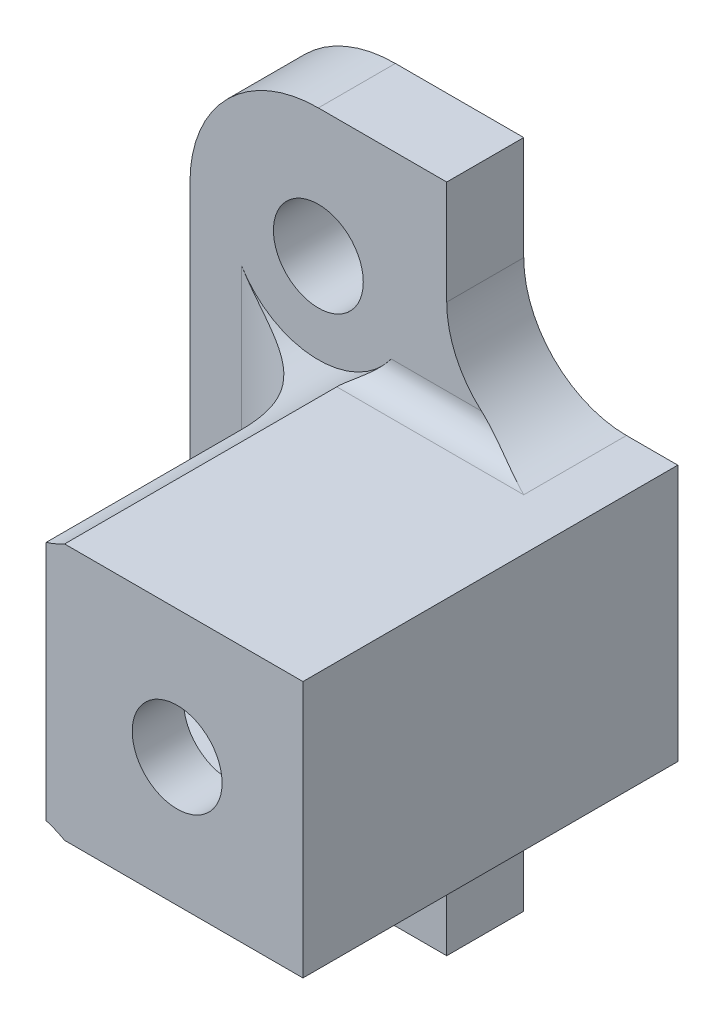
ISO-10303-21;
HEADER;
FILE_DESCRIPTION(('STEP AP214'),'2;1');
FILE_NAME('part.step','',(''),(''),'','','');
FILE_SCHEMA(('AUTOMOTIVE_DESIGN { 1 0 10303 214 1 1 1 1 }'));
ENDSEC;
DATA;
#1=APPLICATION_CONTEXT('core data for automotive mechanical design processes');
#2=APPLICATION_PROTOCOL_DEFINITION('international standard','automotive_design',2000,#1);
#3=PRODUCT_CONTEXT('',#1,'mechanical');
#4=PRODUCT('Part','Part','',(#3));
#5=PRODUCT_RELATED_PRODUCT_CATEGORY('part','',(#4));
#6=PRODUCT_DEFINITION_FORMATION('','',#4);
#7=PRODUCT_DEFINITION_CONTEXT('part definition',#1,'design');
#8=PRODUCT_DEFINITION('design','',#6,#7);
#9=PRODUCT_DEFINITION_SHAPE('','',#8);
#10=(LENGTH_UNIT() NAMED_UNIT(*) SI_UNIT(.MILLI.,.METRE.));
#11=(NAMED_UNIT(*) PLANE_ANGLE_UNIT() SI_UNIT($,.RADIAN.));
#12=(NAMED_UNIT(*) SI_UNIT($,.STERADIAN.) SOLID_ANGLE_UNIT());
#13=UNCERTAINTY_MEASURE_WITH_UNIT(LENGTH_MEASURE(1.E-05),#10,'distance_accuracy_value','');
#14=(GEOMETRIC_REPRESENTATION_CONTEXT(3) GLOBAL_UNCERTAINTY_ASSIGNED_CONTEXT((#13)) GLOBAL_UNIT_ASSIGNED_CONTEXT((#10,
#11,#12)) REPRESENTATION_CONTEXT('',''));
#15=CARTESIAN_POINT('',(0.,0.,0.));
#16=DIRECTION('',(0.,0.,1.));
#17=DIRECTION('',(1.,0.,0.));
#18=AXIS2_PLACEMENT_3D('',#15,#16,#17);
#19=CARTESIAN_POINT('',(0.401709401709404,7.53673020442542,-14.142135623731));
#20=DIRECTION('',(-1.,0.,0.));
#21=DIRECTION('',(0.,-1.,0.));
#22=AXIS2_PLACEMENT_3D('',#19,#20,#21);
#23=PLANE('',#22);
#24=DIRECTION('',(0.,0.,1.));
#25=VECTOR('',#24,1.);
#26=CARTESIAN_POINT('',(0.401709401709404,7.23262823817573,-6.89949493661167));
#27=LINE('',#26,#25);
#28=CARTESIAN_POINT('',(0.401709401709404,7.23262823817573,7.));
#29=VERTEX_POINT('',#28);
#30=CARTESIAN_POINT('',(0.401709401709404,7.23262823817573,14.6));
#31=VERTEX_POINT('',#30);
#32=EDGE_CURVE('E434',#29,#31,#27,.T.);
#33=ORIENTED_EDGE('',*,*,#32,.F.);
#34=DIRECTION('',(0.,-1.,0.));
#35=VECTOR('',#34,1.);
#36=CARTESIAN_POINT('',(0.401709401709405,-2.1591678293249,7.));
#37=LINE('',#36,#35);
#38=CARTESIAN_POINT('',(0.401709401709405,-2.1591678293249,7.));
#39=VERTEX_POINT('',#38);
#40=EDGE_CURVE('E421',#29,#39,#37,.T.);
#41=ORIENTED_EDGE('',*,*,#40,.T.);
#42=DIRECTION('',(0.,0.,1.));
#43=VECTOR('',#42,1.);
#44=CARTESIAN_POINT('',(0.401709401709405,-2.1591678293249,-6.89949493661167));
#45=LINE('',#44,#43);
#46=CARTESIAN_POINT('',(0.401709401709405,-2.1591678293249,14.6));
#47=VERTEX_POINT('',#46);
#48=EDGE_CURVE('E581',#47,#39,#45,.F.);
#49=ORIENTED_EDGE('',*,*,#48,.F.);
#50=DIRECTION('',(0.,-1.,0.));
#51=VECTOR('',#50,1.);
#52=CARTESIAN_POINT('',(0.401709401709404,7.53673020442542,14.6));
#53=LINE('',#52,#51);
#54=EDGE_CURVE('E440',#31,#47,#53,.T.);
#55=ORIENTED_EDGE('',*,*,#54,.F.);
#56=EDGE_LOOP('',(#33,#41,#49,#55));
#57=FACE_BOUND('',#56,.T.);
#58=DIRECTION('',(0.,0.,1.));
#59=VECTOR('',#58,1.);
#60=CARTESIAN_POINT('',(0.401709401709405,-0.363269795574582,9.8));
#61=LINE('',#60,#59);
#62=CARTESIAN_POINT('',(0.401709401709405,-0.363269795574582,9.8));
#63=VERTEX_POINT('',#62);
#64=CARTESIAN_POINT('',(0.401709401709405,-0.363269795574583,12.6));
#65=VERTEX_POINT('',#64);
#66=EDGE_CURVE('E462',#63,#65,#61,.T.);
#67=ORIENTED_EDGE('',*,*,#66,.F.);
#68=DIRECTION('',(0.,-1.,0.));
#69=VECTOR('',#68,1.);
#70=CARTESIAN_POINT('',(0.401709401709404,5.43673020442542,9.8));
#71=LINE('',#70,#69);
#72=CARTESIAN_POINT('',(0.401709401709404,5.43673020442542,9.8));
#73=VERTEX_POINT('',#72);
#74=EDGE_CURVE('E450',#73,#63,#71,.T.);
#75=ORIENTED_EDGE('',*,*,#74,.F.);
#76=DIRECTION('',(0.,0.,1.));
#77=VECTOR('',#76,1.);
#78=CARTESIAN_POINT('',(0.401709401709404,5.43673020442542,9.8));
#79=LINE('',#78,#77);
#80=CARTESIAN_POINT('',(0.401709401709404,5.43673020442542,12.6));
#81=VERTEX_POINT('',#80);
#82=EDGE_CURVE('E471',#73,#81,#79,.T.);
#83=ORIENTED_EDGE('',*,*,#82,.T.);
#84=DIRECTION('',(0.,-1.,0.));
#85=VECTOR('',#84,1.);
#86=CARTESIAN_POINT('',(0.401709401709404,5.43673020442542,12.6));
#87=LINE('',#86,#85);
#88=EDGE_CURVE('E441',#81,#65,#87,.T.);
#89=ORIENTED_EDGE('',*,*,#88,.T.);
#90=EDGE_LOOP('',(#67,#75,#83,#89));
#91=FACE_BOUND('',#90,.T.);
#92=ADVANCED_FACE('F81',(#57,#91),#23,.T.);
#93=CARTESIAN_POINT('',(4.4017094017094,15.5867302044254,3.));
#94=DIRECTION('',(-1.,0.,0.));
#95=DIRECTION('',(0.,-1.,0.));
#96=AXIS2_PLACEMENT_3D('',#93,#94,#95);
#97=PLANE('',#96);
#98=DIRECTION('',(0.,1.,0.));
#99=VECTOR('',#98,1.);
#100=CARTESIAN_POINT('',(4.4017094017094,15.5867302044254,0.));
#101=LINE('',#100,#99);
#102=CARTESIAN_POINT('',(4.4017094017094,-10.5132697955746,0.));
#103=VERTEX_POINT('',#102);
#104=CARTESIAN_POINT('',(4.4017094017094,-6.46326979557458,0.));
#105=VERTEX_POINT('',#104);
#106=EDGE_CURVE('E526',#103,#105,#101,.T.);
#107=ORIENTED_EDGE('',*,*,#106,.T.);
#108=DIRECTION('',(0.,0.,1.));
#109=VECTOR('',#108,1.);
#110=CARTESIAN_POINT('',(4.4017094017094,-6.46326979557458,3.));
#111=LINE('',#110,#109);
#112=CARTESIAN_POINT('',(4.4017094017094,-6.46326979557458,3.));
#113=VERTEX_POINT('',#112);
#114=EDGE_CURVE('E254',#105,#113,#111,.T.);
#115=ORIENTED_EDGE('',*,*,#114,.T.);
#116=DIRECTION('',(0.,1.,0.));
#117=VECTOR('',#116,1.);
#118=CARTESIAN_POINT('',(4.4017094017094,15.5867302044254,3.));
#119=LINE('',#118,#117);
#120=CARTESIAN_POINT('',(4.4017094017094,-10.5132697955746,3.));
#121=VERTEX_POINT('',#120);
#122=EDGE_CURVE('E413',#121,#113,#119,.T.);
#123=ORIENTED_EDGE('',*,*,#122,.F.);
#124=DIRECTION('',(0.,0.,-1.));
#125=VECTOR('',#124,1.);
#126=CARTESIAN_POINT('',(4.4017094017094,-10.5132697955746,3.));
#127=LINE('',#126,#125);
#128=EDGE_CURVE('E532',#121,#103,#127,.T.);
#129=ORIENTED_EDGE('',*,*,#128,.T.);
#130=EDGE_LOOP('',(#107,#115,#123,#129));
#131=FACE_BOUND('',#130,.T.);
#132=ADVANCED_FACE('F329',(#131),#97,.F.);
#133=CARTESIAN_POINT('',(0.,0.,3.));
#134=DIRECTION('',(0.,0.,1.));
#135=DIRECTION('',(1.,0.,0.));
#136=AXIS2_PLACEMENT_3D('',#133,#134,#135);
#137=PLANE('',#136);
#138=CARTESIAN_POINT('',(-0.598290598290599,-5.51326979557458,3.));
#139=DIRECTION('',(0.,0.,1.));
#140=DIRECTION('',(1.,0.,0.));
#141=AXIS2_PLACEMENT_3D('',#138,#139,#140);
#142=CIRCLE('',#141,3.5);
#143=CARTESIAN_POINT('',(-3.5982905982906,-3.71049415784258,3.));
#144=VERTEX_POINT('',#143);
#145=CARTESIAN_POINT('',(2.23852099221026,-3.46326979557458,3.));
#146=VERTEX_POINT('',#145);
#147=EDGE_CURVE('E241',#144,#146,#142,.F.);
#148=ORIENTED_EDGE('',*,*,#147,.F.);
#149=DIRECTION('',(0.,-1.,0.));
#150=VECTOR('',#149,1.);
#151=CARTESIAN_POINT('',(-3.5982905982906,7.23262823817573,3.));
#152=LINE('',#151,#150);
#153=CARTESIAN_POINT('',(-3.5982905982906,8.78395456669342,3.));
#154=VERTEX_POINT('',#153);
#155=EDGE_CURVE('E427',#144,#154,#152,.F.);
#156=ORIENTED_EDGE('',*,*,#155,.T.);
#157=CARTESIAN_POINT('',(-0.598290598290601,10.5867302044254,3.));
#158=DIRECTION('',(0.,0.,1.));
#159=DIRECTION('',(1.,0.,0.));
#160=AXIS2_PLACEMENT_3D('',#157,#158,#159);
#161=CIRCLE('',#160,3.5);
#162=CARTESIAN_POINT('',(2.23852099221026,8.53673020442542,3.));
#163=VERTEX_POINT('',#162);
#164=EDGE_CURVE('E429',#163,#154,#161,.F.);
#165=ORIENTED_EDGE('',*,*,#164,.F.);
#166=DIRECTION('',(-1.,0.,0.));
#167=VECTOR('',#166,1.);
#168=CARTESIAN_POINT('',(4.4017094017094,8.53673020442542,3.));
#169=LINE('',#168,#167);
#170=CARTESIAN_POINT('',(5.75595809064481,8.53673020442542,3.));
#171=VERTEX_POINT('',#170);
#172=EDGE_CURVE('E101',#163,#171,#169,.F.);
#173=ORIENTED_EDGE('',*,*,#172,.T.);
#174=CARTESIAN_POINT('',(8.4017094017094,11.5367302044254,3.));
#175=DIRECTION('',(0.,0.,1.));
#176=DIRECTION('',(1.,0.,0.));
#177=AXIS2_PLACEMENT_3D('',#174,#175,#176);
#178=CIRCLE('',#177,4.);
#179=CARTESIAN_POINT('',(4.4017094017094,11.5367302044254,3.));
#180=VERTEX_POINT('',#179);
#181=EDGE_CURVE('E395',#171,#180,#178,.F.);
#182=ORIENTED_EDGE('',*,*,#181,.T.);
#183=CARTESIAN_POINT('',(4.4017094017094,15.5867302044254,3.));
#184=VERTEX_POINT('',#183);
#185=EDGE_CURVE('E403',#180,#184,#119,.T.);
#186=ORIENTED_EDGE('',*,*,#185,.T.);
#187=DIRECTION('',(-1.,0.,0.));
#188=VECTOR('',#187,1.);
#189=CARTESIAN_POINT('',(-5.5982905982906,15.5867302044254,3.));
#190=LINE('',#189,#188);
#191=CARTESIAN_POINT('',(-0.598290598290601,15.5867302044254,3.));
#192=VERTEX_POINT('',#191);
#193=EDGE_CURVE('E519',#184,#192,#190,.T.);
#194=ORIENTED_EDGE('',*,*,#193,.T.);
#195=CARTESIAN_POINT('',(-0.598290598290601,10.5867302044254,3.));
#196=DIRECTION('',(0.,0.,1.));
#197=DIRECTION('',(1.,0.,0.));
#198=AXIS2_PLACEMENT_3D('',#195,#196,#197);
#199=CIRCLE('',#198,5.);
#200=CARTESIAN_POINT('',(-5.5982905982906,10.5867302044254,3.));
#201=VERTEX_POINT('',#200);
#202=EDGE_CURVE('E547',#192,#201,#199,.T.);
#203=ORIENTED_EDGE('',*,*,#202,.T.);
#204=DIRECTION('',(0.,-1.,0.));
#205=VECTOR('',#204,1.);
#206=CARTESIAN_POINT('',(-5.5982905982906,15.5867302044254,3.));
#207=LINE('',#206,#205);
#208=CARTESIAN_POINT('',(-5.5982905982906,-5.51326979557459,3.));
#209=VERTEX_POINT('',#208);
#210=EDGE_CURVE('E514',#201,#209,#207,.T.);
#211=ORIENTED_EDGE('',*,*,#210,.T.);
#212=CARTESIAN_POINT('',(-0.598290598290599,-5.51326979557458,3.));
#213=DIRECTION('',(0.,0.,1.));
#214=DIRECTION('',(1.,0.,0.));
#215=AXIS2_PLACEMENT_3D('',#212,#213,#214);
#216=CIRCLE('',#215,5.);
#217=CARTESIAN_POINT('',(-0.598290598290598,-10.5132697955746,3.));
#218=VERTEX_POINT('',#217);
#219=EDGE_CURVE('E549',#209,#218,#216,.T.);
#220=ORIENTED_EDGE('',*,*,#219,.T.);
#221=DIRECTION('',(1.,0.,0.));
#222=VECTOR('',#221,1.);
#223=CARTESIAN_POINT('',(-5.5982905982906,-10.5132697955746,3.));
#224=LINE('',#223,#222);
#225=EDGE_CURVE('E414',#218,#121,#224,.T.);
#226=ORIENTED_EDGE('',*,*,#225,.T.);
#227=ORIENTED_EDGE('',*,*,#122,.T.);
#228=CARTESIAN_POINT('',(8.4017094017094,-6.46326979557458,3.));
#229=DIRECTION('',(0.,0.,1.));
#230=DIRECTION('',(1.,0.,0.));
#231=AXIS2_PLACEMENT_3D('',#228,#229,#230);
#232=CIRCLE('',#231,4.);
#233=CARTESIAN_POINT('',(5.75595809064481,-3.46326979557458,3.));
#234=VERTEX_POINT('',#233);
#235=EDGE_CURVE('E260',#113,#234,#232,.F.);
#236=ORIENTED_EDGE('',*,*,#235,.T.);
#237=DIRECTION('',(1.,0.,0.));
#238=VECTOR('',#237,1.);
#239=CARTESIAN_POINT('',(0.401709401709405,-3.46326979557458,3.));
#240=LINE('',#239,#238);
#241=EDGE_CURVE('E109',#234,#146,#240,.F.);
#242=ORIENTED_EDGE('',*,*,#241,.T.);
#243=EDGE_LOOP('',(#148,#156,#165,#173,#182,#186,#194,#203,#211,#220,#226,#227,#236,#242));
#244=FACE_BOUND('',#243,.T.);
#245=CARTESIAN_POINT('',(-0.598290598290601,10.5867302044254,3.));
#246=DIRECTION('',(0.,0.,1.));
#247=DIRECTION('',(1.,0.,0.));
#248=AXIS2_PLACEMENT_3D('',#245,#246,#247);
#249=CIRCLE('',#248,1.75);
#250=CARTESIAN_POINT('',(1.1517094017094,10.5867302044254,3.));
#251=VERTEX_POINT('',#250);
#252=EDGE_CURVE('E508',#251,#251,#249,.T.);
#253=ORIENTED_EDGE('',*,*,#252,.F.);
#254=EDGE_LOOP('',(#253));
#255=FACE_BOUND('',#254,.T.);
#256=CARTESIAN_POINT('',(-0.598290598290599,-5.51326979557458,3.));
#257=DIRECTION('',(0.,0.,1.));
#258=DIRECTION('',(1.,0.,0.));
#259=AXIS2_PLACEMENT_3D('',#256,#257,#258);
#260=CIRCLE('',#259,1.75);
#261=CARTESIAN_POINT('',(1.1517094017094,-5.51326979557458,3.));
#262=VERTEX_POINT('',#261);
#263=EDGE_CURVE('E502',#262,#262,#260,.T.);
#264=ORIENTED_EDGE('',*,*,#263,.F.);
#265=EDGE_LOOP('',(#264));
#266=FACE_BOUND('',#265,.T.);
#267=ADVANCED_FACE('F257',(#244,#255,#266),#137,.T.);
#268=CARTESIAN_POINT('',(0.,0.,0.));
#269=DIRECTION('',(0.,0.,1.));
#270=DIRECTION('',(1.,0.,0.));
#271=AXIS2_PLACEMENT_3D('',#268,#269,#270);
#272=PLANE('',#271);
#273=CARTESIAN_POINT('',(5.5017094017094,2.53673020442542,0.));
#274=DIRECTION('',(0.,0.,1.));
#275=DIRECTION('',(1.,0.,0.));
#276=AXIS2_PLACEMENT_3D('',#273,#274,#275);
#277=CIRCLE('',#276,1.75);
#278=CARTESIAN_POINT('',(7.2517094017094,2.53673020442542,0.));
#279=VERTEX_POINT('',#278);
#280=EDGE_CURVE('E573',#279,#279,#277,.T.);
#281=ORIENTED_EDGE('',*,*,#280,.T.);
#282=EDGE_LOOP('',(#281));
#283=FACE_BOUND('',#282,.T.);
#284=DIRECTION('',(-1.,0.,0.));
#285=VECTOR('',#284,1.);
#286=CARTESIAN_POINT('',(0.401709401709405,-2.46326979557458,0.));
#287=LINE('',#286,#285);
#288=CARTESIAN_POINT('',(10.4017094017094,-2.46326979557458,0.));
#289=VERTEX_POINT('',#288);
#290=CARTESIAN_POINT('',(8.4017094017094,-2.46326979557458,0.));
#291=VERTEX_POINT('',#290);
#292=EDGE_CURVE('E490',#289,#291,#287,.T.);
#293=ORIENTED_EDGE('',*,*,#292,.T.);
#294=CARTESIAN_POINT('',(8.4017094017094,-6.46326979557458,0.));
#295=DIRECTION('',(0.,0.,1.));
#296=DIRECTION('',(1.,0.,0.));
#297=AXIS2_PLACEMENT_3D('',#294,#295,#296);
#298=CIRCLE('',#297,4.);
#299=EDGE_CURVE('E377',#291,#105,#298,.T.);
#300=ORIENTED_EDGE('',*,*,#299,.T.);
#301=ORIENTED_EDGE('',*,*,#106,.F.);
#302=DIRECTION('',(1.,0.,0.));
#303=VECTOR('',#302,1.);
#304=CARTESIAN_POINT('',(-5.5982905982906,-10.5132697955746,0.));
#305=LINE('',#304,#303);
#306=CARTESIAN_POINT('',(-0.598290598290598,-10.5132697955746,0.));
#307=VERTEX_POINT('',#306);
#308=EDGE_CURVE('E523',#307,#103,#305,.T.);
#309=ORIENTED_EDGE('',*,*,#308,.F.);
#310=CARTESIAN_POINT('',(-0.598290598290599,-5.51326979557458,0.));
#311=DIRECTION('',(0.,0.,1.));
#312=DIRECTION('',(1.,0.,0.));
#313=AXIS2_PLACEMENT_3D('',#310,#311,#312);
#314=CIRCLE('',#313,5.);
#315=CARTESIAN_POINT('',(-5.5982905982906,-5.51326979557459,0.));
#316=VERTEX_POINT('',#315);
#317=EDGE_CURVE('E540',#307,#316,#314,.F.);
#318=ORIENTED_EDGE('',*,*,#317,.T.);
#319=DIRECTION('',(0.,-1.,0.));
#320=VECTOR('',#319,1.);
#321=CARTESIAN_POINT('',(-5.5982905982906,15.5867302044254,0.));
#322=LINE('',#321,#320);
#323=CARTESIAN_POINT('',(-5.5982905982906,10.5867302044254,0.));
#324=VERTEX_POINT('',#323);
#325=EDGE_CURVE('E511',#324,#316,#322,.T.);
#326=ORIENTED_EDGE('',*,*,#325,.F.);
#327=CARTESIAN_POINT('',(-0.598290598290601,10.5867302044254,0.));
#328=DIRECTION('',(0.,0.,1.));
#329=DIRECTION('',(1.,0.,0.));
#330=AXIS2_PLACEMENT_3D('',#327,#328,#329);
#331=CIRCLE('',#330,5.);
#332=CARTESIAN_POINT('',(-0.598290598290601,15.5867302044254,0.));
#333=VERTEX_POINT('',#332);
#334=EDGE_CURVE('E538',#324,#333,#331,.F.);
#335=ORIENTED_EDGE('',*,*,#334,.T.);
#336=DIRECTION('',(-1.,0.,0.));
#337=VECTOR('',#336,1.);
#338=CARTESIAN_POINT('',(-5.5982905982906,15.5867302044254,0.));
#339=LINE('',#338,#337);
#340=CARTESIAN_POINT('',(4.4017094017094,15.5867302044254,0.));
#341=VERTEX_POINT('',#340);
#342=EDGE_CURVE('E517',#341,#333,#339,.T.);
#343=ORIENTED_EDGE('',*,*,#342,.F.);
#344=CARTESIAN_POINT('',(4.4017094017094,11.5367302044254,0.));
#345=VERTEX_POINT('',#344);
#346=EDGE_CURVE('E525',#345,#341,#101,.T.);
#347=ORIENTED_EDGE('',*,*,#346,.F.);
#348=CARTESIAN_POINT('',(8.4017094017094,11.5367302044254,0.));
#349=DIRECTION('',(0.,0.,1.));
#350=DIRECTION('',(1.,0.,0.));
#351=AXIS2_PLACEMENT_3D('',#348,#349,#350);
#352=CIRCLE('',#351,4.);
#353=CARTESIAN_POINT('',(8.4017094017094,7.53673020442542,0.));
#354=VERTEX_POINT('',#353);
#355=EDGE_CURVE('E396',#345,#354,#352,.T.);
#356=ORIENTED_EDGE('',*,*,#355,.T.);
#357=DIRECTION('',(1.,0.,0.));
#358=VECTOR('',#357,1.);
#359=CARTESIAN_POINT('',(0.401709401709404,7.53673020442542,0.));
#360=LINE('',#359,#358);
#361=CARTESIAN_POINT('',(10.4017094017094,7.53673020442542,0.));
#362=VERTEX_POINT('',#361);
#363=EDGE_CURVE('E494',#354,#362,#360,.T.);
#364=ORIENTED_EDGE('',*,*,#363,.T.);
#365=DIRECTION('',(0.,-1.,0.));
#366=VECTOR('',#365,1.);
#367=CARTESIAN_POINT('',(10.4017094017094,7.53673020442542,0.));
#368=LINE('',#367,#366);
#369=EDGE_CURVE('E495',#362,#289,#368,.T.);
#370=ORIENTED_EDGE('',*,*,#369,.T.);
#371=EDGE_LOOP('',(#293,#300,#301,#309,#318,#326,#335,#343,#347,#356,#364,#370));
#372=FACE_BOUND('',#371,.T.);
#373=CARTESIAN_POINT('',(-0.598290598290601,10.5867302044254,0.));
#374=DIRECTION('',(0.,0.,1.));
#375=DIRECTION('',(1.,0.,0.));
#376=AXIS2_PLACEMENT_3D('',#373,#374,#375);
#377=CIRCLE('',#376,1.75);
#378=CARTESIAN_POINT('',(1.1517094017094,10.5867302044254,0.));
#379=VERTEX_POINT('',#378);
#380=EDGE_CURVE('E505',#379,#379,#377,.T.);
#381=ORIENTED_EDGE('',*,*,#380,.T.);
#382=EDGE_LOOP('',(#381));
#383=FACE_BOUND('',#382,.T.);
#384=CARTESIAN_POINT('',(-0.598290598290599,-5.51326979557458,0.));
#385=DIRECTION('',(0.,0.,1.));
#386=DIRECTION('',(1.,0.,0.));
#387=AXIS2_PLACEMENT_3D('',#384,#385,#386);
#388=CIRCLE('',#387,1.75);
#389=CARTESIAN_POINT('',(1.1517094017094,-5.51326979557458,0.));
#390=VERTEX_POINT('',#389);
#391=EDGE_CURVE('E493',#390,#390,#388,.T.);
#392=ORIENTED_EDGE('',*,*,#391,.T.);
#393=EDGE_LOOP('',(#392));
#394=FACE_BOUND('',#393,.T.);
#395=ADVANCED_FACE('F343',(#283,#372,#383,#394),#272,.F.);
#396=CARTESIAN_POINT('',(-5.5982905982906,15.5867302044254,3.));
#397=DIRECTION('',(1.,0.,0.));
#398=DIRECTION('',(0.,1.,0.));
#399=AXIS2_PLACEMENT_3D('',#396,#397,#398);
#400=PLANE('',#399);
#401=ORIENTED_EDGE('',*,*,#325,.T.);
#402=DIRECTION('',(0.,0.,-1.));
#403=VECTOR('',#402,1.);
#404=CARTESIAN_POINT('',(-5.5982905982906,-5.51326979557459,3.));
#405=LINE('',#404,#403);
#406=EDGE_CURVE('E545',#316,#209,#405,.F.);
#407=ORIENTED_EDGE('',*,*,#406,.T.);
#408=ORIENTED_EDGE('',*,*,#210,.F.);
#409=DIRECTION('',(0.,0.,-1.));
#410=VECTOR('',#409,1.);
#411=CARTESIAN_POINT('',(-5.5982905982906,10.5867302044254,3.));
#412=LINE('',#411,#410);
#413=EDGE_CURVE('E542',#201,#324,#412,.T.);
#414=ORIENTED_EDGE('',*,*,#413,.T.);
#415=EDGE_LOOP('',(#401,#407,#408,#414));
#416=FACE_BOUND('',#415,.T.);
#417=ADVANCED_FACE('F346',(#416),#400,.F.);
#418=CARTESIAN_POINT('',(-5.5982905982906,-10.5132697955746,3.));
#419=DIRECTION('',(0.,1.,0.));
#420=DIRECTION('',(-1.,0.,0.));
#421=AXIS2_PLACEMENT_3D('',#418,#419,#420);
#422=PLANE('',#421);
#423=ORIENTED_EDGE('',*,*,#225,.F.);
#424=DIRECTION('',(0.,0.,-1.));
#425=VECTOR('',#424,1.);
#426=CARTESIAN_POINT('',(-0.598290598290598,-10.5132697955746,3.));
#427=LINE('',#426,#425);
#428=EDGE_CURVE('E535',#218,#307,#427,.T.);
#429=ORIENTED_EDGE('',*,*,#428,.T.);
#430=ORIENTED_EDGE('',*,*,#308,.T.);
#431=ORIENTED_EDGE('',*,*,#128,.F.);
#432=EDGE_LOOP('',(#423,#429,#430,#431));
#433=FACE_BOUND('',#432,.T.);
#434=ADVANCED_FACE('F354',(#433),#422,.F.);
#435=ORIENTED_EDGE('',*,*,#185,.F.);
#436=DIRECTION('',(0.,0.,-1.));
#437=VECTOR('',#436,1.);
#438=CARTESIAN_POINT('',(4.4017094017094,11.5367302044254,3.));
#439=LINE('',#438,#437);
#440=EDGE_CURVE('E408',#180,#345,#439,.T.);
#441=ORIENTED_EDGE('',*,*,#440,.T.);
#442=ORIENTED_EDGE('',*,*,#346,.T.);
#443=DIRECTION('',(0.,0.,-1.));
#444=VECTOR('',#443,1.);
#445=CARTESIAN_POINT('',(4.4017094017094,15.5867302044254,3.));
#446=LINE('',#445,#444);
#447=EDGE_CURVE('E411',#184,#341,#446,.T.);
#448=ORIENTED_EDGE('',*,*,#447,.F.);
#449=EDGE_LOOP('',(#435,#441,#442,#448));
#450=FACE_BOUND('',#449,.T.);
#451=ADVANCED_FACE('F350',(#450),#97,.F.);
#452=CARTESIAN_POINT('',(-5.5982905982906,15.5867302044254,3.));
#453=DIRECTION('',(0.,-1.,0.));
#454=DIRECTION('',(1.,0.,0.));
#455=AXIS2_PLACEMENT_3D('',#452,#453,#454);
#456=PLANE('',#455);
#457=ORIENTED_EDGE('',*,*,#342,.T.);
#458=DIRECTION('',(0.,0.,-1.));
#459=VECTOR('',#458,1.);
#460=CARTESIAN_POINT('',(-0.598290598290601,15.5867302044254,3.));
#461=LINE('',#460,#459);
#462=EDGE_CURVE('E551',#333,#192,#461,.F.);
#463=ORIENTED_EDGE('',*,*,#462,.T.);
#464=ORIENTED_EDGE('',*,*,#193,.F.);
#465=ORIENTED_EDGE('',*,*,#447,.T.);
#466=EDGE_LOOP('',(#457,#463,#464,#465));
#467=FACE_BOUND('',#466,.T.);
#468=ADVANCED_FACE('F339',(#467),#456,.F.);
#469=CARTESIAN_POINT('',(-0.598290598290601,10.5867302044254,3.));
#470=DIRECTION('',(0.,0.,-1.));
#471=DIRECTION('',(-1.,0.,0.));
#472=AXIS2_PLACEMENT_3D('',#469,#470,#471);
#473=CYLINDRICAL_SURFACE('',#472,1.75);
#474=ORIENTED_EDGE('',*,*,#252,.T.);
#475=EDGE_LOOP('',(#474));
#476=FACE_BOUND('',#475,.T.);
#477=ORIENTED_EDGE('',*,*,#380,.F.);
#478=EDGE_LOOP('',(#477));
#479=FACE_BOUND('',#478,.T.);
#480=ADVANCED_FACE('F335',(#476,#479),#473,.F.);
#481=CARTESIAN_POINT('',(-0.598290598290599,-5.51326979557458,3.));
#482=DIRECTION('',(0.,0.,-1.));
#483=DIRECTION('',(-1.,0.,0.));
#484=AXIS2_PLACEMENT_3D('',#481,#482,#483);
#485=CYLINDRICAL_SURFACE('',#484,1.75);
#486=ORIENTED_EDGE('',*,*,#263,.T.);
#487=EDGE_LOOP('',(#486));
#488=FACE_BOUND('',#487,.T.);
#489=ORIENTED_EDGE('',*,*,#391,.F.);
#490=EDGE_LOOP('',(#489));
#491=FACE_BOUND('',#490,.T.);
#492=ADVANCED_FACE('F331',(#488,#491),#485,.F.);
#493=CARTESIAN_POINT('',(-0.598290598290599,-5.51326979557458,3.));
#494=DIRECTION('',(0.,0.,-1.));
#495=DIRECTION('',(-1.,0.,0.));
#496=AXIS2_PLACEMENT_3D('',#493,#494,#495);
#497=CYLINDRICAL_SURFACE('',#496,5.);
#498=ORIENTED_EDGE('',*,*,#219,.F.);
#499=ORIENTED_EDGE('',*,*,#406,.F.);
#500=ORIENTED_EDGE('',*,*,#317,.F.);
#501=ORIENTED_EDGE('',*,*,#428,.F.);
#502=EDGE_LOOP('',(#498,#499,#500,#501));
#503=FACE_BOUND('',#502,.T.);
#504=ADVANCED_FACE('F334',(#503),#497,.T.);
#505=CARTESIAN_POINT('',(-0.598290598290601,10.5867302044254,3.));
#506=DIRECTION('',(0.,0.,-1.));
#507=DIRECTION('',(-1.,0.,0.));
#508=AXIS2_PLACEMENT_3D('',#505,#506,#507);
#509=CYLINDRICAL_SURFACE('',#508,5.);
#510=ORIENTED_EDGE('',*,*,#202,.F.);
#511=ORIENTED_EDGE('',*,*,#462,.F.);
#512=ORIENTED_EDGE('',*,*,#334,.F.);
#513=ORIENTED_EDGE('',*,*,#413,.F.);
#514=EDGE_LOOP('',(#510,#511,#512,#513));
#515=FACE_BOUND('',#514,.T.);
#516=ADVANCED_FACE('F325',(#515),#509,.T.);
#517=CARTESIAN_POINT('',(0.401709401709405,-2.46326979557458,-14.142135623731));
#518=DIRECTION('',(0.,-1.,0.));
#519=DIRECTION('',(0.,0.,-1.));
#520=AXIS2_PLACEMENT_3D('',#517,#518,#519);
#521=PLANE('',#520);
#522=DIRECTION('',(1.,0.,0.));
#523=VECTOR('',#522,1.);
#524=CARTESIAN_POINT('',(4.4017094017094,-2.46326979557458,4.));
#525=LINE('',#524,#523);
#526=CARTESIAN_POINT('',(1.11853787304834,-2.46326979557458,4.));
#527=VERTEX_POINT('',#526);
#528=CARTESIAN_POINT('',(8.4017094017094,-2.46326979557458,4.));
#529=VERTEX_POINT('',#528);
#530=EDGE_CURVE('E253',#527,#529,#525,.T.);
#531=ORIENTED_EDGE('',*,*,#530,.T.);
#532=DIRECTION('',(0.,0.,1.));
#533=VECTOR('',#532,1.);
#534=CARTESIAN_POINT('',(8.4017094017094,-2.46326979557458,-14.142135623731));
#535=LINE('',#534,#533);
#536=EDGE_CURVE('E418',#529,#291,#535,.F.);
#537=ORIENTED_EDGE('',*,*,#536,.T.);
#538=ORIENTED_EDGE('',*,*,#292,.F.);
#539=DIRECTION('',(0.,0.,1.));
#540=VECTOR('',#539,1.);
#541=CARTESIAN_POINT('',(10.4017094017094,-2.46326979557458,-14.142135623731));
#542=LINE('',#541,#540);
#543=CARTESIAN_POINT('',(10.4017094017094,-2.46326979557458,14.6));
#544=VERTEX_POINT('',#543);
#545=EDGE_CURVE('E489',#289,#544,#542,.T.);
#546=ORIENTED_EDGE('',*,*,#545,.T.);
#547=DIRECTION('',(1.,0.,0.));
#548=VECTOR('',#547,1.);
#549=CARTESIAN_POINT('',(0.401709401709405,-2.46326979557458,14.6));
#550=LINE('',#549,#548);
#551=CARTESIAN_POINT('',(1.11853787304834,-2.46326979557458,14.6));
#552=VERTEX_POINT('',#551);
#553=EDGE_CURVE('E481',#552,#544,#550,.T.);
#554=ORIENTED_EDGE('',*,*,#553,.F.);
#555=DIRECTION('',(0.,0.,1.));
#556=VECTOR('',#555,1.);
#557=CARTESIAN_POINT('',(1.11853787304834,-2.46326979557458,-6.89949493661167));
#558=LINE('',#557,#556);
#559=EDGE_CURVE('E248',#527,#552,#558,.T.);
#560=ORIENTED_EDGE('',*,*,#559,.F.);
#561=EDGE_LOOP('',(#531,#537,#538,#546,#554,#560));
#562=FACE_BOUND('',#561,.T.);
#563=ADVANCED_FACE('F321',(#562),#521,.T.);
#564=CARTESIAN_POINT('',(10.4017094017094,7.53673020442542,-14.142135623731));
#565=DIRECTION('',(1.,0.,0.));
#566=DIRECTION('',(0.,1.,0.));
#567=AXIS2_PLACEMENT_3D('',#564,#565,#566);
#568=PLANE('',#567);
#569=DIRECTION('',(0.,1.,0.));
#570=VECTOR('',#569,1.);
#571=CARTESIAN_POINT('',(10.4017094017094,7.53673020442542,14.6));
#572=LINE('',#571,#570);
#573=CARTESIAN_POINT('',(10.4017094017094,7.53673020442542,14.6));
#574=VERTEX_POINT('',#573);
#575=EDGE_CURVE('E483',#544,#574,#572,.T.);
#576=ORIENTED_EDGE('',*,*,#575,.F.);
#577=ORIENTED_EDGE('',*,*,#545,.F.);
#578=ORIENTED_EDGE('',*,*,#369,.F.);
#579=DIRECTION('',(0.,0.,1.));
#580=VECTOR('',#579,1.);
#581=CARTESIAN_POINT('',(10.4017094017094,7.53673020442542,-14.142135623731));
#582=LINE('',#581,#580);
#583=EDGE_CURVE('E497',#362,#574,#582,.T.);
#584=ORIENTED_EDGE('',*,*,#583,.T.);
#585=EDGE_LOOP('',(#576,#577,#578,#584));
#586=FACE_BOUND('',#585,.T.);
#587=ADVANCED_FACE('F317',(#586),#568,.T.);
#588=CARTESIAN_POINT('',(0.401709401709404,7.53673020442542,-14.142135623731));
#589=DIRECTION('',(0.,1.,0.));
#590=DIRECTION('',(0.,0.,1.));
#591=AXIS2_PLACEMENT_3D('',#588,#589,#590);
#592=PLANE('',#591);
#593=ORIENTED_EDGE('',*,*,#363,.F.);
#594=DIRECTION('',(0.,0.,-1.));
#595=VECTOR('',#594,1.);
#596=CARTESIAN_POINT('',(8.4017094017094,7.53673020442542,-14.142135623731));
#597=LINE('',#596,#595);
#598=CARTESIAN_POINT('',(8.4017094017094,7.53673020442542,4.));
#599=VERTEX_POINT('',#598);
#600=EDGE_CURVE('E417',#354,#599,#597,.F.);
#601=ORIENTED_EDGE('',*,*,#600,.T.);
#602=DIRECTION('',(-1.,0.,0.));
#603=VECTOR('',#602,1.);
#604=CARTESIAN_POINT('',(0.401709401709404,7.53673020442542,4.));
#605=LINE('',#604,#603);
#606=CARTESIAN_POINT('',(1.11853787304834,7.53673020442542,4.));
#607=VERTEX_POINT('',#606);
#608=EDGE_CURVE('E262',#599,#607,#605,.T.);
#609=ORIENTED_EDGE('',*,*,#608,.T.);
#610=DIRECTION('',(0.,0.,1.));
#611=VECTOR('',#610,1.);
#612=CARTESIAN_POINT('',(1.11853787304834,7.53673020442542,-6.89949493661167));
#613=LINE('',#612,#611);
#614=CARTESIAN_POINT('',(1.11853787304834,7.53673020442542,14.6));
#615=VERTEX_POINT('',#614);
#616=EDGE_CURVE('E442',#615,#607,#613,.F.);
#617=ORIENTED_EDGE('',*,*,#616,.F.);
#618=DIRECTION('',(-1.,0.,0.));
#619=VECTOR('',#618,1.);
#620=CARTESIAN_POINT('',(0.401709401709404,7.53673020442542,14.6));
#621=LINE('',#620,#619);
#622=EDGE_CURVE('E486',#574,#615,#621,.T.);
#623=ORIENTED_EDGE('',*,*,#622,.F.);
#624=ORIENTED_EDGE('',*,*,#583,.F.);
#625=EDGE_LOOP('',(#593,#601,#609,#617,#623,#624));
#626=FACE_BOUND('',#625,.T.);
#627=ADVANCED_FACE('F313',(#626),#592,.T.);
#628=CARTESIAN_POINT('',(0.,0.,14.6));
#629=DIRECTION('',(0.,0.,1.));
#630=DIRECTION('',(1.,0.,0.));
#631=AXIS2_PLACEMENT_3D('',#628,#629,#630);
#632=PLANE('',#631);
#633=CARTESIAN_POINT('',(5.5017094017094,2.53673020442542,14.6));
#634=DIRECTION('',(0.,0.,1.));
#635=DIRECTION('',(1.,0.,0.));
#636=AXIS2_PLACEMENT_3D('',#633,#634,#635);
#637=CIRCLE('',#636,1.75);
#638=CARTESIAN_POINT('',(7.2517094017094,2.53673020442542,14.6));
#639=VERTEX_POINT('',#638);
#640=EDGE_CURVE('E586',#639,#639,#637,.T.);
#641=ORIENTED_EDGE('',*,*,#640,.F.);
#642=EDGE_LOOP('',(#641));
#643=FACE_BOUND('',#642,.T.);
#644=CARTESIAN_POINT('',(-0.598290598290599,-5.51326979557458,14.6));
#645=DIRECTION('',(0.,0.,1.));
#646=DIRECTION('',(1.,0.,0.));
#647=AXIS2_PLACEMENT_3D('',#644,#645,#646);
#648=CIRCLE('',#647,3.5);
#649=EDGE_CURVE('E249',#552,#47,#648,.T.);
#650=ORIENTED_EDGE('',*,*,#649,.F.);
#651=ORIENTED_EDGE('',*,*,#553,.T.);
#652=ORIENTED_EDGE('',*,*,#575,.T.);
#653=ORIENTED_EDGE('',*,*,#622,.T.);
#654=CARTESIAN_POINT('',(-0.598290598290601,10.5867302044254,14.6));
#655=DIRECTION('',(0.,0.,1.));
#656=DIRECTION('',(1.,0.,0.));
#657=AXIS2_PLACEMENT_3D('',#654,#655,#656);
#658=CIRCLE('',#657,3.5);
#659=EDGE_CURVE('E570',#31,#615,#658,.T.);
#660=ORIENTED_EDGE('',*,*,#659,.F.);
#661=ORIENTED_EDGE('',*,*,#54,.T.);
#662=EDGE_LOOP('',(#650,#651,#652,#653,#660,#661));
#663=FACE_BOUND('',#662,.T.);
#664=ADVANCED_FACE('F310',(#643,#663),#632,.T.);
#665=CARTESIAN_POINT('',(0.401709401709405,-3.46326979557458,4.));
#666=DIRECTION('',(-1.,0.,0.));
#667=DIRECTION('',(0.,0.,1.));
#668=AXIS2_PLACEMENT_3D('',#665,#666,#667);
#669=CYLINDRICAL_SURFACE('',#668,1.);
#670=ORIENTED_EDGE('',*,*,#530,.F.);
#671=CARTESIAN_POINT('',(2.23852099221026,-3.46326979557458,5.));
#672=CARTESIAN_POINT('',(2.18884038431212,-3.39452645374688,4.99999992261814));
#673=CARTESIAN_POINT('',(2.13663920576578,-3.3275983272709,4.99291403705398));
#674=CARTESIAN_POINT('',(2.02880153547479,-3.19908339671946,4.96670677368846));
#675=CARTESIAN_POINT('',(1.97316028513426,-3.137504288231,4.9475683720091));
#676=CARTESIAN_POINT('',(1.85787114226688,-3.01839669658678,4.89799977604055));
#677=CARTESIAN_POINT('',(1.79815119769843,-2.96110388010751,4.8671762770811));
#678=CARTESIAN_POINT('',(1.67834830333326,-2.85368775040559,4.79535687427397));
#679=CARTESIAN_POINT('',(1.6182653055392,-2.80356540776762,4.75435959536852));
#680=CARTESIAN_POINT('',(1.51245854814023,-2.72073171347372,4.67179043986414));
#681=CARTESIAN_POINT('',(1.46636262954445,-2.68657232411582,4.63213675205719));
#682=CARTESIAN_POINT('',(1.37724883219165,-2.62360098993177,4.54572573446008));
#683=CARTESIAN_POINT('',(1.33422484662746,-2.59477824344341,4.49898310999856));
#684=CARTESIAN_POINT('',(1.27133471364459,-2.55433885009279,4.4182640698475));
#685=CARTESIAN_POINT('',(1.24928865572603,-2.5405568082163,4.38708291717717));
#686=CARTESIAN_POINT('',(1.2086935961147,-2.51570925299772,4.32149095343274));
#687=CARTESIAN_POINT('',(1.19013980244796,-2.50464001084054,4.28708466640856));
#688=CARTESIAN_POINT('',(1.16192055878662,-2.48806508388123,4.2231665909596));
#689=CARTESIAN_POINT('',(1.15119368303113,-2.48186705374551,4.19431281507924));
#690=CARTESIAN_POINT('',(1.13392484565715,-2.47196580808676,4.13497151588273));
#691=CARTESIAN_POINT('',(1.12737615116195,-2.46825857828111,4.10448670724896));
#692=CARTESIAN_POINT('',(1.11927255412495,-2.46367947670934,4.04236264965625));
#693=CARTESIAN_POINT('',(1.11775927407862,-2.46283123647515,4.01071595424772));
#694=CARTESIAN_POINT('',(1.12008513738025,-2.46414109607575,3.94768140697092));
#695=CARTESIAN_POINT('',(1.12392657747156,-2.46630048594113,3.91629367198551));
#696=CARTESIAN_POINT('',(1.13692780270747,-2.47368514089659,3.8521659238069));
#697=CARTESIAN_POINT('',(1.14652139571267,-2.47916090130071,3.81954600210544));
#698=CARTESIAN_POINT('',(1.17006740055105,-2.49282366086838,3.75652634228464));
#699=CARTESIAN_POINT('',(1.18402871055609,-2.50101619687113,3.72613129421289));
#700=CARTESIAN_POINT('',(1.22406534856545,-2.52498853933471,3.65074080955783));
#701=CARTESIAN_POINT('',(1.25246564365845,-2.54241084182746,3.60752516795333));
#702=CARTESIAN_POINT('',(1.3136209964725,-2.5813894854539,3.52637369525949));
#703=CARTESIAN_POINT('',(1.34638864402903,-2.60295786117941,3.48845380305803));
#704=CARTESIAN_POINT('',(1.40934721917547,-2.64610603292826,3.4224566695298));
#705=CARTESIAN_POINT('',(1.43920936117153,-2.66721854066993,3.39375187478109));
#706=CARTESIAN_POINT('',(1.49999216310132,-2.71172852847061,3.33937899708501));
#707=CARTESIAN_POINT('',(1.53091349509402,-2.73512747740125,3.31371288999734));
#708=CARTESIAN_POINT('',(1.62452342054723,-2.80857636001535,3.24096178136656));
#709=CARTESIAN_POINT('',(1.68804370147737,-2.86186878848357,3.19813815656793));
#710=CARTESIAN_POINT('',(1.81712552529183,-2.97877092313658,3.12232951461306));
#711=CARTESIAN_POINT('',(1.88266312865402,-3.04271564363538,3.08982344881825));
#712=CARTESIAN_POINT('',(2.01084466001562,-3.17851497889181,3.03866931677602));
#713=CARTESIAN_POINT('',(2.07349373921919,-3.25035467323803,3.01999560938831));
#714=CARTESIAN_POINT('',(2.17940557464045,-3.38259048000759,3.00158898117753));
#715=CARTESIAN_POINT('',(2.22373756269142,-3.44164956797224,2.99840975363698));
#716=CARTESIAN_POINT('',(2.3083718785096,-3.5621914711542,3.00308467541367));
#717=CARTESIAN_POINT('',(2.34867895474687,-3.62367130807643,3.01092565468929));
#718=CARTESIAN_POINT('',(2.41833844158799,-3.73740608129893,3.03682620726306));
#719=CARTESIAN_POINT('',(2.44842052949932,-3.78961434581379,3.05311419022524));
#720=CARTESIAN_POINT('',(2.50438120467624,-3.89251355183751,3.09510657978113));
#721=CARTESIAN_POINT('',(2.53026119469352,-3.94320499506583,3.12080783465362));
#722=CARTESIAN_POINT('',(2.57755151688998,-4.04119430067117,3.18186104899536));
#723=CARTESIAN_POINT('',(2.59893764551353,-4.08847292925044,3.2172630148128));
#724=CARTESIAN_POINT('',(2.63693922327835,-4.17700106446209,3.29705375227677));
#725=CARTESIAN_POINT('',(2.65355617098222,-4.21825246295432,3.34143969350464));
#726=CARTESIAN_POINT('',(2.6807876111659,-4.2889554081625,3.43319434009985));
#727=CARTESIAN_POINT('',(2.69182797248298,-4.31916337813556,3.47985617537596));
#728=CARTESIAN_POINT('',(2.71039559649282,-4.37161602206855,3.57809398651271));
#729=CARTESIAN_POINT('',(2.7179237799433,-4.39386278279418,3.62966867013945));
#730=CARTESIAN_POINT('',(2.72948321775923,-4.42872097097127,3.7339180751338));
#731=CARTESIAN_POINT('',(2.73364731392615,-4.44169580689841,3.78645703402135));
#732=CARTESIAN_POINT('',(2.73916438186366,-4.45900313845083,3.89308260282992));
#733=CARTESIAN_POINT('',(2.74051756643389,-4.46333628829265,3.94716909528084));
#734=CARTESIAN_POINT('',(2.74047531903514,-4.46320225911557,4.05491389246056));
#735=CARTESIAN_POINT('',(2.73910083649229,-4.45880215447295,4.10857230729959));
#736=CARTESIAN_POINT('',(2.7335828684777,-4.44149528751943,4.21435174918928));
#737=CARTESIAN_POINT('',(2.72943945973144,-4.4285887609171,4.26647281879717));
#738=CARTESIAN_POINT('',(2.71821654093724,-4.39474587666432,4.36769478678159));
#739=CARTESIAN_POINT('',(2.71113747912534,-4.37381074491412,4.41679614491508));
#740=CARTESIAN_POINT('',(2.69381928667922,-4.32470467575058,4.510620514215));
#741=CARTESIAN_POINT('',(2.68358035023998,-4.29653418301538,4.55534379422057));
#742=CARTESIAN_POINT('',(2.65965892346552,-4.23385873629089,4.63950121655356));
#743=CARTESIAN_POINT('',(2.64595600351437,-4.19931654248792,4.67890177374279));
#744=CARTESIAN_POINT('',(2.61501561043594,-4.12536966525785,4.75119823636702));
#745=CARTESIAN_POINT('',(2.59777794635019,-4.08596471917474,4.78409379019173));
#746=CARTESIAN_POINT('',(2.55918860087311,-4.00247466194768,4.84378563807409));
#747=CARTESIAN_POINT('',(2.53772421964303,-3.95828107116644,4.8703565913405));
#748=CARTESIAN_POINT('',(2.49126145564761,-3.86789648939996,4.915882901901));
#749=CARTESIAN_POINT('',(2.4662620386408,-3.82170491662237,4.93483602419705));
#750=CARTESIAN_POINT('',(2.40975767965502,-3.72294423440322,4.96726219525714));
#751=CARTESIAN_POINT('',(2.37783026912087,-3.67029761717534,4.97975817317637));
#752=CARTESIAN_POINT('',(2.31056959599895,-3.56585968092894,4.99613071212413));
#753=CARTESIAN_POINT('',(2.2752335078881,-3.5140691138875,5.00000005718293));
#754=CARTESIAN_POINT('',(2.23852099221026,-3.46326979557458,5.));
#755=B_SPLINE_CURVE_WITH_KNOTS('',3,(#671,#672,#673,#674,#675,#676,#677,#678,#679,#680,#681,
#682,#683,#684,#685,#686,#687,#688,#689,#690,#691,#692,#693,#694,#695,#696,#697,#698,#699,#700,
#701,#702,#703,#704,#705,#706,#707,#708,#709,#710,#711,#712,#713,#714,#715,#716,#717,#718,#719,
#720,#721,#722,#723,#724,#725,#726,#727,#728,#729,#730,#731,#732,#733,#734,#735,#736,#737,#738,
#739,#740,#741,#742,#743,#744,#745,#746,#747,#748,#749,#750,#751,#752,#753,#754),.UNSPECIFIED.,
.T.,.F.,(4,2,2,2,2,2,2,2,2,2,2,2,2,2,2,2,2,2,2,2,2,2,2,2,2,2,2,2,2,2,2,2,2,2,2,2,2,2,2,2,2,4),
(0.,0.254209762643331,0.508779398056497,0.772812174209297,1.03688065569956,1.24565015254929,
1.45399235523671,1.57552946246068,1.69689856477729,1.79076058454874,1.88447096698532,
1.97895405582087,2.07347768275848,2.17622868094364,2.27919038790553,2.44198495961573,
2.60525940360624,2.74454436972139,2.88391941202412,3.16273546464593,3.45305771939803,
3.7428404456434,3.9637657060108,4.18442716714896,4.37089781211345,4.55730608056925,
4.74469395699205,4.93202288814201,5.10118229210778,5.27029732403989,5.43235374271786,
5.59439789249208,5.7552023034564,5.91600225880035,6.07677767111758,6.23754320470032,
6.39927995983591,6.56102545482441,6.72787728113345,6.89477802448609,7.08247465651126,
7.27032823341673),.UNSPECIFIED.);
#756=EDGE_CURVE('E244',#527,#146,#755,.T.);
#757=ORIENTED_EDGE('',*,*,#756,.T.);
#758=ORIENTED_EDGE('',*,*,#241,.F.);
#759=CARTESIAN_POINT('',(5.75595809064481,-3.46326979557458,3.));
#760=CARTESIAN_POINT('',(5.80479297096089,-3.42018850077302,3.00002225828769));
#761=CARTESIAN_POINT('',(5.85464311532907,-3.37835753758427,3.00278131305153));
#762=CARTESIAN_POINT('',(5.95593097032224,-3.29746195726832,3.01299606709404));
#763=CARTESIAN_POINT('',(6.00736545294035,-3.25839218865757,3.02044274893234));
#764=CARTESIAN_POINT('',(6.11114718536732,-3.18342270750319,3.03918561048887));
#765=CARTESIAN_POINT('',(6.16348367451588,-3.14749989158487,3.05045013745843));
#766=CARTESIAN_POINT('',(6.26925519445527,-3.07850562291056,3.07625009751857));
#767=CARTESIAN_POINT('',(6.3226909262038,-3.04543606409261,3.09078768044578));
#768=CARTESIAN_POINT('',(6.46042806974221,-2.96457289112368,3.13147169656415));
#769=CARTESIAN_POINT('',(6.5453597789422,-2.9188250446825,3.1595766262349));
#770=CARTESIAN_POINT('',(6.71676029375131,-2.83420750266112,3.22089220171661));
#771=CARTESIAN_POINT('',(6.80322962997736,-2.79534023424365,3.2541046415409));
#772=CARTESIAN_POINT('',(7.06518123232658,-2.68843633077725,3.35989549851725));
#773=CARTESIAN_POINT('',(7.24248395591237,-2.63051523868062,3.43839391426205));
#774=CARTESIAN_POINT('',(7.58148179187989,-2.54476042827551,3.5956023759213));
#775=CARTESIAN_POINT('',(7.74297203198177,-2.51450410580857,3.67351220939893));
#776=CARTESIAN_POINT('',(8.06648622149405,-2.47402296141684,3.83241536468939));
#777=CARTESIAN_POINT('',(8.22850749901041,-2.46374352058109,3.91339965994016));
#778=CARTESIAN_POINT('',(8.39416699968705,-2.46327513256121,3.99622880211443));
#779=CARTESIAN_POINT('',(8.39793824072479,-2.4632697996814,3.9981144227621));
#780=CARTESIAN_POINT('',(8.4017094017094,-2.46326979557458,4.));
#781=B_SPLINE_CURVE_WITH_KNOTS('',3,(#759,#760,#761,#762,#763,#764,#765,#766,#767,#768,#769,
#770,#771,#772,#773,#774,#775,#776,#777,#778,#779,#780),.UNSPECIFIED.,.F.,.F.,(4,2,2,2,2,2,2,2,
2,2,4),(0.,0.195194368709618,0.390014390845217,0.583257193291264,0.776627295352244,
1.07759313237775,1.37866492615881,1.98338003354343,2.52784959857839,3.07082842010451,
3.08347754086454),.UNSPECIFIED.);
#782=EDGE_CURVE('E371',#234,#529,#781,.T.);
#783=ORIENTED_EDGE('',*,*,#782,.T.);
#784=EDGE_LOOP('',(#670,#757,#758,#783));
#785=FACE_BOUND('',#784,.T.);
#786=ADVANCED_FACE('F252',(#785),#669,.F.);
#787=CARTESIAN_POINT('',(0.401709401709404,8.53673020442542,4.));
#788=DIRECTION('',(1.,0.,0.));
#789=DIRECTION('',(0.,0.,-1.));
#790=AXIS2_PLACEMENT_3D('',#787,#788,#789);
#791=CYLINDRICAL_SURFACE('',#790,1.);
#792=ORIENTED_EDGE('',*,*,#172,.F.);
#793=CARTESIAN_POINT('',(2.23852099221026,8.53673020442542,3.));
#794=CARTESIAN_POINT('',(2.21358576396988,8.50221788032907,3.00000450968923));
#795=CARTESIAN_POINT('',(2.18803564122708,8.46819538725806,3.00178579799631));
#796=CARTESIAN_POINT('',(2.13591028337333,8.40133887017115,3.0086378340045));
#797=CARTESIAN_POINT('',(2.10933614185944,8.36850364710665,3.01370515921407));
#798=CARTESIAN_POINT('',(2.02853729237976,8.27226282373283,3.03339002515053));
#799=CARTESIAN_POINT('',(1.97301807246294,8.21082157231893,3.0524951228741));
#800=CARTESIAN_POINT('',(1.85791250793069,8.09189589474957,3.10197999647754));
#801=CARTESIAN_POINT('',(1.79825200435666,8.03465970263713,3.13277094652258));
#802=CARTESIAN_POINT('',(1.67845454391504,7.92723840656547,3.2045717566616));
#803=CARTESIAN_POINT('',(1.61831690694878,7.87706662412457,3.24560052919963));
#804=CARTESIAN_POINT('',(1.51244867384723,7.79418406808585,3.32821695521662));
#805=CARTESIAN_POINT('',(1.46634395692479,7.76001882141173,3.36787904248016));
#806=CARTESIAN_POINT('',(1.37723173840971,7.69705002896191,3.45429316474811));
#807=CARTESIAN_POINT('',(1.33421693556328,7.66823357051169,3.50102761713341));
#808=CARTESIAN_POINT('',(1.27133723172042,7.62780087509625,3.58173236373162));
#809=CARTESIAN_POINT('',(1.24929346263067,7.61402024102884,3.61290934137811));
#810=CARTESIAN_POINT('',(1.20869773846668,7.58917211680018,3.67850232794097));
#811=CARTESIAN_POINT('',(1.19014175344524,7.57810149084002,3.71291452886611));
#812=CARTESIAN_POINT('',(1.16199564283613,7.56156965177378,3.77666056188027));
#813=CARTESIAN_POINT('',(1.15132439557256,7.555403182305,3.80532632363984));
#814=CARTESIAN_POINT('',(1.13412533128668,7.54554039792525,3.86425363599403));
#815=CARTESIAN_POINT('',(1.12758462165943,7.54183639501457,3.89450989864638));
#816=CARTESIAN_POINT('',(1.12186467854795,7.53860476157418,3.93754242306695));
#817=CARTESIAN_POINT('',(1.12062155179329,7.53790383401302,3.94998153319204));
#818=CARTESIAN_POINT('',(1.11895702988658,7.53696608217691,3.9749448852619));
#819=CARTESIAN_POINT('',(1.11853649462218,7.536729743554,3.98746920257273));
#820=CARTESIAN_POINT('',(1.11853787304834,7.53673020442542,4.));
#821=B_SPLINE_CURVE_WITH_KNOTS('',3,(#793,#794,#795,#796,#797,#798,#799,#800,#801,#802,#803,
#804,#805,#806,#807,#808,#809,#810,#811,#812,#813,#814,#815,#816,#817,#818,#819,#820),
.UNSPECIFIED.,.F.,.F.,(4,2,2,2,2,2,2,2,2,2,2,2,2,4),(0.,0.127627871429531,0.255123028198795,
0.50901295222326,0.772818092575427,1.03711421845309,1.24592550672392,1.45422594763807,
1.57574969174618,1.69713214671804,1.79042031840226,1.88341585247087,1.92094742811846,
1.95851821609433),.UNSPECIFIED.);
#822=EDGE_CURVE('E255',#163,#607,#821,.T.);
#823=ORIENTED_EDGE('',*,*,#822,.T.);
#824=ORIENTED_EDGE('',*,*,#608,.F.);
#825=CARTESIAN_POINT('',(5.75595809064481,8.53673020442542,3.));
#826=CARTESIAN_POINT('',(5.8047929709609,8.49364890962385,3.00002225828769));
#827=CARTESIAN_POINT('',(5.85464311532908,8.45181794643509,3.00278131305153));
#828=CARTESIAN_POINT('',(5.95593097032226,8.37092236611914,3.01299606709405));
#829=CARTESIAN_POINT('',(6.00736545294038,8.33185259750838,3.02044274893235));
#830=CARTESIAN_POINT('',(6.11114718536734,8.25688311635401,3.03918561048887));
#831=CARTESIAN_POINT('',(6.1634836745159,8.22096030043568,3.05045013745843));
#832=CARTESIAN_POINT('',(6.26925519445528,8.15196603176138,3.07625009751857));
#833=CARTESIAN_POINT('',(6.3226909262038,8.11889647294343,3.09078768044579));
#834=CARTESIAN_POINT('',(6.4604280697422,8.03803329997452,3.13147169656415));
#835=CARTESIAN_POINT('',(6.54535977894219,7.99228545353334,3.1595766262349));
#836=CARTESIAN_POINT('',(6.71676029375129,7.90766791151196,3.2208922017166));
#837=CARTESIAN_POINT('',(6.80322962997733,7.8688006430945,3.25410464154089));
#838=CARTESIAN_POINT('',(7.06518123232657,7.7618967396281,3.35989549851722));
#839=CARTESIAN_POINT('',(7.2424839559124,7.70397564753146,3.43839391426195));
#840=CARTESIAN_POINT('',(7.58148179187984,7.61822083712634,3.59560237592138));
#841=CARTESIAN_POINT('',(7.74297203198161,7.5879645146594,3.67351220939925));
#842=CARTESIAN_POINT('',(8.06648622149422,7.54748337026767,3.83241536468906));
#843=CARTESIAN_POINT('',(8.22850749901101,7.53720392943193,3.91339965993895));
#844=CARTESIAN_POINT('',(8.39416699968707,7.53673554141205,3.99622880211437));
#845=CARTESIAN_POINT('',(8.3979382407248,7.53673020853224,3.99811442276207));
#846=CARTESIAN_POINT('',(8.4017094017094,7.53673020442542,4.));
#847=B_SPLINE_CURVE_WITH_KNOTS('',3,(#825,#826,#827,#828,#829,#830,#831,#832,#833,#834,#835,
#836,#837,#838,#839,#840,#841,#842,#843,#844,#845,#846),.UNSPECIFIED.,.F.,.F.,(4,2,2,2,2,2,2,2,
2,2,4),(0.,0.195194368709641,0.390014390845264,0.58325719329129,0.776627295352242,
1.07759313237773,1.37866492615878,1.98338003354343,2.52784959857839,3.07082842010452,
3.08347754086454),.UNSPECIFIED.);
#848=EDGE_CURVE('E390',#599,#171,#847,.F.);
#849=ORIENTED_EDGE('',*,*,#848,.T.);
#850=EDGE_LOOP('',(#792,#823,#824,#849));
#851=FACE_BOUND('',#850,.T.);
#852=ADVANCED_FACE('F279',(#851),#791,.F.);
#853=CARTESIAN_POINT('',(0.401709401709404,5.43673020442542,9.8));
#854=DIRECTION('',(0.,1.,0.));
#855=DIRECTION('',(0.,0.,1.));
#856=AXIS2_PLACEMENT_3D('',#853,#854,#855);
#857=PLANE('',#856);
#858=DIRECTION('',(-1.,0.,0.));
#859=VECTOR('',#858,1.);
#860=CARTESIAN_POINT('',(0.401709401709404,5.43673020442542,12.6));
#861=LINE('',#860,#859);
#862=CARTESIAN_POINT('',(8.8017094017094,5.43673020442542,12.6));
#863=VERTEX_POINT('',#862);
#864=EDGE_CURVE('E454',#863,#81,#861,.T.);
#865=ORIENTED_EDGE('',*,*,#864,.T.);
#866=ORIENTED_EDGE('',*,*,#82,.F.);
#867=DIRECTION('',(-1.,0.,0.));
#868=VECTOR('',#867,1.);
#869=CARTESIAN_POINT('',(0.401709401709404,5.43673020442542,9.8));
#870=LINE('',#869,#868);
#871=CARTESIAN_POINT('',(8.8017094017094,5.43673020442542,9.8));
#872=VERTEX_POINT('',#871);
#873=EDGE_CURVE('E460',#872,#73,#870,.T.);
#874=ORIENTED_EDGE('',*,*,#873,.F.);
#875=DIRECTION('',(0.,0.,1.));
#876=VECTOR('',#875,1.);
#877=CARTESIAN_POINT('',(8.8017094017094,5.43673020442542,9.8));
#878=LINE('',#877,#876);
#879=EDGE_CURVE('E474',#872,#863,#878,.T.);
#880=ORIENTED_EDGE('',*,*,#879,.T.);
#881=EDGE_LOOP('',(#865,#866,#874,#880));
#882=FACE_BOUND('',#881,.T.);
#883=ADVANCED_FACE('F299',(#882),#857,.F.);
#884=CARTESIAN_POINT('',(8.8017094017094,5.43673020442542,9.8));
#885=DIRECTION('',(1.,0.,0.));
#886=DIRECTION('',(0.,1.,0.));
#887=AXIS2_PLACEMENT_3D('',#884,#885,#886);
#888=PLANE('',#887);
#889=DIRECTION('',(0.,1.,0.));
#890=VECTOR('',#889,1.);
#891=CARTESIAN_POINT('',(8.8017094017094,5.43673020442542,12.6));
#892=LINE('',#891,#890);
#893=CARTESIAN_POINT('',(8.80170940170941,-0.363269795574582,12.6));
#894=VERTEX_POINT('',#893);
#895=EDGE_CURVE('E466',#894,#863,#892,.T.);
#896=ORIENTED_EDGE('',*,*,#895,.T.);
#897=ORIENTED_EDGE('',*,*,#879,.F.);
#898=DIRECTION('',(0.,1.,0.));
#899=VECTOR('',#898,1.);
#900=CARTESIAN_POINT('',(8.8017094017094,5.43673020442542,9.8));
#901=LINE('',#900,#899);
#902=CARTESIAN_POINT('',(8.80170940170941,-0.363269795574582,9.8));
#903=VERTEX_POINT('',#902);
#904=EDGE_CURVE('E457',#903,#872,#901,.T.);
#905=ORIENTED_EDGE('',*,*,#904,.F.);
#906=DIRECTION('',(0.,0.,1.));
#907=VECTOR('',#906,1.);
#908=CARTESIAN_POINT('',(8.80170940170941,-0.363269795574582,9.8));
#909=LINE('',#908,#907);
#910=EDGE_CURVE('E476',#903,#894,#909,.T.);
#911=ORIENTED_EDGE('',*,*,#910,.T.);
#912=EDGE_LOOP('',(#896,#897,#905,#911));
#913=FACE_BOUND('',#912,.T.);
#914=ADVANCED_FACE('F302',(#913),#888,.F.);
#915=CARTESIAN_POINT('',(0.401709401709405,-0.363269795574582,9.8));
#916=DIRECTION('',(0.,-1.,0.));
#917=DIRECTION('',(0.,0.,-1.));
#918=AXIS2_PLACEMENT_3D('',#915,#916,#917);
#919=PLANE('',#918);
#920=DIRECTION('',(1.,0.,0.));
#921=VECTOR('',#920,1.);
#922=CARTESIAN_POINT('',(0.401709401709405,-0.363269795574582,12.6));
#923=LINE('',#922,#921);
#924=EDGE_CURVE('E445',#65,#894,#923,.T.);
#925=ORIENTED_EDGE('',*,*,#924,.T.);
#926=ORIENTED_EDGE('',*,*,#910,.F.);
#927=DIRECTION('',(1.,0.,0.));
#928=VECTOR('',#927,1.);
#929=CARTESIAN_POINT('',(0.401709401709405,-0.363269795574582,9.8));
#930=LINE('',#929,#928);
#931=EDGE_CURVE('E453',#63,#903,#930,.T.);
#932=ORIENTED_EDGE('',*,*,#931,.F.);
#933=ORIENTED_EDGE('',*,*,#66,.T.);
#934=EDGE_LOOP('',(#925,#926,#932,#933));
#935=FACE_BOUND('',#934,.T.);
#936=ADVANCED_FACE('F294',(#935),#919,.F.);
#937=CARTESIAN_POINT('',(0.,0.,9.8));
#938=DIRECTION('',(0.,0.,1.));
#939=DIRECTION('',(1.,0.,0.));
#940=AXIS2_PLACEMENT_3D('',#937,#938,#939);
#941=PLANE('',#940);
#942=CARTESIAN_POINT('',(5.5017094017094,2.53673020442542,9.8));
#943=DIRECTION('',(0.,0.,1.));
#944=DIRECTION('',(1.,0.,0.));
#945=AXIS2_PLACEMENT_3D('',#942,#943,#944);
#946=CIRCLE('',#945,1.75);
#947=CARTESIAN_POINT('',(7.2517094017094,2.53673020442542,9.8));
#948=VERTEX_POINT('',#947);
#949=EDGE_CURVE('E576',#948,#948,#946,.T.);
#950=ORIENTED_EDGE('',*,*,#949,.F.);
#951=EDGE_LOOP('',(#950));
#952=FACE_BOUND('',#951,.T.);
#953=ORIENTED_EDGE('',*,*,#74,.T.);
#954=ORIENTED_EDGE('',*,*,#931,.T.);
#955=ORIENTED_EDGE('',*,*,#904,.T.);
#956=ORIENTED_EDGE('',*,*,#873,.T.);
#957=EDGE_LOOP('',(#953,#954,#955,#956));
#958=FACE_BOUND('',#957,.T.);
#959=ADVANCED_FACE('F290',(#952,#958),#941,.T.);
#960=CARTESIAN_POINT('',(0.,0.,12.6));
#961=DIRECTION('',(0.,0.,1.));
#962=DIRECTION('',(1.,0.,0.));
#963=AXIS2_PLACEMENT_3D('',#960,#961,#962);
#964=PLANE('',#963);
#965=CARTESIAN_POINT('',(5.5017094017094,2.53673020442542,12.6));
#966=DIRECTION('',(0.,0.,1.));
#967=DIRECTION('',(1.,0.,0.));
#968=AXIS2_PLACEMENT_3D('',#965,#966,#967);
#969=CIRCLE('',#968,1.75);
#970=CARTESIAN_POINT('',(7.2517094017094,2.53673020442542,12.6));
#971=VERTEX_POINT('',#970);
#972=EDGE_CURVE('E585',#971,#971,#969,.T.);
#973=ORIENTED_EDGE('',*,*,#972,.T.);
#974=EDGE_LOOP('',(#973));
#975=FACE_BOUND('',#974,.T.);
#976=ORIENTED_EDGE('',*,*,#88,.F.);
#977=ORIENTED_EDGE('',*,*,#864,.F.);
#978=ORIENTED_EDGE('',*,*,#895,.F.);
#979=ORIENTED_EDGE('',*,*,#924,.F.);
#980=EDGE_LOOP('',(#976,#977,#978,#979));
#981=FACE_BOUND('',#980,.T.);
#982=ADVANCED_FACE('F286',(#975,#981),#964,.F.);
#983=CARTESIAN_POINT('',(-0.598290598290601,10.5867302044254,-6.89949493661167));
#984=DIRECTION('',(0.,0.,1.));
#985=DIRECTION('',(1.,0.,0.));
#986=AXIS2_PLACEMENT_3D('',#983,#984,#985);
#987=CYLINDRICAL_SURFACE('',#986,3.5);
#988=ORIENTED_EDGE('',*,*,#164,.T.);
#989=CARTESIAN_POINT('',(-3.5982905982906,8.78395456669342,3.));
#990=CARTESIAN_POINT('',(-3.55335592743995,8.7091586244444,3.0000045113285));
#991=CARTESIAN_POINT('',(-3.50560005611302,8.63604240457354,3.00075726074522));
#992=CARTESIAN_POINT('',(-3.40476720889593,8.49357716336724,3.0043642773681));
#993=CARTESIAN_POINT('',(-3.35168752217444,8.42423008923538,3.00721961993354));
#994=CARTESIAN_POINT('',(-3.24037566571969,8.28954712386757,3.01565320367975));
#995=CARTESIAN_POINT('',(-3.1821256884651,8.22422652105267,3.02124117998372));
#996=CARTESIAN_POINT('',(-3.06110792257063,8.09832681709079,3.03576641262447));
#997=CARTESIAN_POINT('',(-2.99834092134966,8.03774689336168,3.0447030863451));
#998=CARTESIAN_POINT('',(-2.86855444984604,7.92148628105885,3.06657485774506));
#999=CARTESIAN_POINT('',(-2.80151732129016,7.86582856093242,3.07952754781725));
#1000=CARTESIAN_POINT('',(-2.66414112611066,7.76011173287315,3.10997269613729));
#1001=CARTESIAN_POINT('',(-2.59380233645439,7.71005215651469,3.12746477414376));
#1002=CARTESIAN_POINT('',(-2.45081455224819,7.61596253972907,3.16740384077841));
#1003=CARTESIAN_POINT('',(-2.37817198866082,7.57191727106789,3.1898379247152));
#1004=CARTESIAN_POINT('',(-2.23131315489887,7.48990778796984,3.24002772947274));
#1005=CARTESIAN_POINT('',(-2.15709702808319,7.45194302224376,3.26778296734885));
#1006=CARTESIAN_POINT('',(-2.01369220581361,7.38478914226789,3.32650168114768));
#1007=CARTESIAN_POINT('',(-1.94454760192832,7.3551535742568,3.35706399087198));
#1008=CARTESIAN_POINT('',(-1.80648145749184,7.3010377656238,3.42295190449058));
#1009=CARTESIAN_POINT('',(-1.73755999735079,7.27655921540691,3.45827906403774));
#1010=CARTESIAN_POINT('',(-1.6006690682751,7.23256743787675,3.53364567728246));
#1011=CARTESIAN_POINT('',(-1.53270008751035,7.21305667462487,3.57368745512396));
#1012=CARTESIAN_POINT('',(-1.39841675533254,7.17870880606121,3.65831329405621));
#1013=CARTESIAN_POINT('',(-1.33210306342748,7.16387353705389,3.70289913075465));
#1014=CARTESIAN_POINT('',(-1.13723053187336,7.12595536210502,3.84269584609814));
#1015=CARTESIAN_POINT('',(-1.01197019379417,7.10922504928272,3.94436665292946));
#1016=CARTESIAN_POINT('',(-0.774232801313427,7.08911197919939,4.16260290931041));
#1017=CARTESIAN_POINT('',(-0.661757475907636,7.08573102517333,4.27917036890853));
#1018=CARTESIAN_POINT('',(-0.436221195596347,7.0884065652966,4.54322222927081));
#1019=CARTESIAN_POINT('',(-0.325549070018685,7.0959376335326,4.69272773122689));
#1020=CARTESIAN_POINT('',(-0.126070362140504,7.1172762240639,5.00547138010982));
#1021=CARTESIAN_POINT('',(-0.037290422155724,7.13109133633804,5.1687259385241));
#1022=CARTESIAN_POINT('',(0.0849560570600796,7.15376136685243,5.43617386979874));
#1023=CARTESIAN_POINT('',(0.126131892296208,7.16231127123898,5.5369468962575));
#1024=CARTESIAN_POINT('',(0.200146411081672,7.17880701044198,5.74154893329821));
#1025=CARTESIAN_POINT('',(0.232987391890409,7.18675301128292,5.84537709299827));
#1026=CARTESIAN_POINT('',(0.29007716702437,7.2012215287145,6.05532078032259));
#1027=CARTESIAN_POINT('',(0.314336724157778,7.2077458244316,6.161433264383));
#1028=CARTESIAN_POINT('',(0.354129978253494,7.21874516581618,6.37534373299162));
#1029=CARTESIAN_POINT('',(0.369668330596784,7.22322130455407,6.48314078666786));
#1030=CARTESIAN_POINT('',(0.387757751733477,7.22849259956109,6.6592970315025));
#1031=CARTESIAN_POINT('',(0.392991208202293,7.23003799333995,6.72736983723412));
#1032=CARTESIAN_POINT('',(0.399965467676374,7.23210815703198,6.86362577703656));
#1033=CARTESIAN_POINT('',(0.401710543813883,7.23263417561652,6.93180867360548));
#1034=CARTESIAN_POINT('',(0.401709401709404,7.23262823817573,7.));
#1035=B_SPLINE_CURVE_WITH_KNOTS('',3,(#989,#990,#991,#992,#993,#994,#995,#996,#997,#998,#999,
#1000,#1001,#1002,#1003,#1004,#1005,#1006,#1007,#1008,#1009,#1010,#1011,#1012,#1013,#1014,#1015,
#1016,#1017,#1018,#1019,#1020,#1021,#1022,#1023,#1024,#1025,#1026,#1027,#1028,#1029,#1030,#1031,
#1032,#1033,#1034),.UNSPECIFIED.,.F.,.F.,(4,2,2,2,2,2,2,2,2,2,2,2,2,2,2,2,2,2,2,2,2,2,4),(0.,
0.261722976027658,0.523579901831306,0.786376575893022,1.04912754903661,1.31304618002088,
1.57694271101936,1.84015814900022,2.1033497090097,2.34664426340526,2.59001844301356,
2.83351310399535,3.07710327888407,3.56159048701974,4.04614313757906,4.60258481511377,
5.15970036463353,5.48697406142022,5.81415745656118,6.14092903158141,6.46752600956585,
6.67231019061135,6.87684336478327),.UNSPECIFIED.);
#1036=EDGE_CURVE('E12',#154,#29,#1035,.T.);
#1037=ORIENTED_EDGE('',*,*,#1036,.T.);
#1038=ORIENTED_EDGE('',*,*,#32,.T.);
#1039=ORIENTED_EDGE('',*,*,#659,.T.);
#1040=ORIENTED_EDGE('',*,*,#616,.T.);
#1041=ORIENTED_EDGE('',*,*,#822,.F.);
#1042=EDGE_LOOP('',(#988,#1037,#1038,#1039,#1040,#1041));
#1043=FACE_BOUND('',#1042,.T.);
#1044=ADVANCED_FACE('F282',(#1043),#987,.F.);
#1045=CARTESIAN_POINT('',(-0.598290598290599,-5.51326979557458,-6.89949493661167));
#1046=DIRECTION('',(0.,0.,1.));
#1047=DIRECTION('',(1.,0.,0.));
#1048=AXIS2_PLACEMENT_3D('',#1045,#1046,#1047);
#1049=CYLINDRICAL_SURFACE('',#1048,3.5);
#1050=ORIENTED_EDGE('',*,*,#48,.T.);
#1051=CARTESIAN_POINT('',(0.401709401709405,-2.1591678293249,7.));
#1052=CARTESIAN_POINT('',(0.401723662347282,-2.15921518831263,6.88889696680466));
#1053=CARTESIAN_POINT('',(0.397081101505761,-2.1577890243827,6.7778051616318));
#1054=CARTESIAN_POINT('',(0.378592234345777,-2.15233694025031,6.55649393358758));
#1055=CARTESIAN_POINT('',(0.364749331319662,-2.14831198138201,6.44627420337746));
#1056=CARTESIAN_POINT('',(0.327984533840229,-2.13801332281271,6.22756296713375));
#1057=CARTESIAN_POINT('',(0.305070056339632,-2.13174146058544,6.11907012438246));
#1058=CARTESIAN_POINT('',(0.250351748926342,-2.11759476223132,5.90445587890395));
#1059=CARTESIAN_POINT('',(0.218547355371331,-2.10971982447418,5.79833462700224));
#1060=CARTESIAN_POINT('',(0.146294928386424,-2.09318754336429,5.58921920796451));
#1061=CARTESIAN_POINT('',(0.105853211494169,-2.08453077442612,5.48622281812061));
#1062=CARTESIAN_POINT('',(0.0165763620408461,-2.0674026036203,5.28390390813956));
#1063=CARTESIAN_POINT('',(-0.032262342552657,-2.05893128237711,5.18458297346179));
#1064=CARTESIAN_POINT('',(-0.190902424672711,-2.03541179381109,4.89322947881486));
#1065=CARTESIAN_POINT('',(-0.312941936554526,-2.02222581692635,4.70747642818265));
#1066=CARTESIAN_POINT('',(-0.564741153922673,-2.01154605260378,4.38612252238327));
#1067=CARTESIAN_POINT('',(-0.690210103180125,-2.01189601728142,4.24723930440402));
#1068=CARTESIAN_POINT('',(-0.891498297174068,-2.02492381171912,4.0534794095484));
#1069=CARTESIAN_POINT('',(-0.96079073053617,-2.03135282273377,3.99130899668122));
#1070=CARTESIAN_POINT('',(-1.10314937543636,-2.04913115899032,3.87224288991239));
#1071=CARTESIAN_POINT('',(-1.17621380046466,-2.06047817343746,3.81534473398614));
#1072=CARTESIAN_POINT('',(-1.32604928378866,-2.08891119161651,3.70674062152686));
#1073=CARTESIAN_POINT('',(-1.40284721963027,-2.10604663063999,3.65508455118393));
#1074=CARTESIAN_POINT('',(-1.55862313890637,-2.14663392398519,3.55788103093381));
#1075=CARTESIAN_POINT('',(-1.63760112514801,-2.17008578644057,3.51233358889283));
#1076=CARTESIAN_POINT('',(-1.79656424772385,-2.22371552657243,3.42762199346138));
#1077=CARTESIAN_POINT('',(-1.87654807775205,-2.25388539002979,3.38845032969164));
#1078=CARTESIAN_POINT('',(-2.03643867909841,-2.32120933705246,3.31648232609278));
#1079=CARTESIAN_POINT('',(-2.11634545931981,-2.35836248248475,3.28368513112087));
#1080=CARTESIAN_POINT('',(-2.26401267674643,-2.43410042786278,3.22838989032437));
#1081=CARTESIAN_POINT('',(-2.3319368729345,-2.47179114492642,3.20509636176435));
#1082=CARTESIAN_POINT('',(-2.46613076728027,-2.55230765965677,3.16292272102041));
#1083=CARTESIAN_POINT('',(-2.53239979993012,-2.59513548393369,3.14404435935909));
#1084=CARTESIAN_POINT('',(-2.66266326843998,-2.68578466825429,3.11038108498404));
#1085=CARTESIAN_POINT('',(-2.7266542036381,-2.73361330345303,3.09560225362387));
#1086=CARTESIAN_POINT('',(-2.85165619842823,-2.83394752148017,3.06978227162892));
#1087=CARTESIAN_POINT('',(-2.91266699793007,-2.88645351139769,3.0587414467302));
#1088=CARTESIAN_POINT('',(-3.03267582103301,-2.99720097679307,3.03971409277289));
#1089=CARTESIAN_POINT('',(-3.0915844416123,-3.05555360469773,3.03181149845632));
#1090=CARTESIAN_POINT('',(-3.20525923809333,-3.17647635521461,3.01894499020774));
#1091=CARTESIAN_POINT('',(-3.26002474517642,-3.23904715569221,3.0139815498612));
#1092=CARTESIAN_POINT('',(-3.36486614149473,-3.36782570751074,3.00647145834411));
#1093=CARTESIAN_POINT('',(-3.41495525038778,-3.43402231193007,3.00391779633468));
#1094=CARTESIAN_POINT('',(-3.51030742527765,-3.5698056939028,3.00068438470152));
#1095=CARTESIAN_POINT('',(-3.55557264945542,-3.63939093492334,3.00000379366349));
#1096=CARTESIAN_POINT('',(-3.5982905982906,-3.71049415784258,3.));
#1097=B_SPLINE_CURVE_WITH_KNOTS('',3,(#1051,#1052,#1053,#1054,#1055,#1056,#1057,#1058,#1059,
#1060,#1061,#1062,#1063,#1064,#1065,#1066,#1067,#1068,#1069,#1070,#1071,#1072,#1073,#1074,#1075,
#1076,#1077,#1078,#1079,#1080,#1081,#1082,#1083,#1084,#1085,#1086,#1087,#1088,#1089,#1090,#1091,
#1092,#1093,#1094,#1095,#1096),.UNSPECIFIED.,.F.,.F.,(4,2,2,2,2,2,2,2,2,2,2,2,2,2,2,2,2,2,2,2,2,
2,4),(0.,0.333185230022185,0.666247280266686,0.999037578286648,1.33184898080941,1.6644178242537,
1.99712849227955,2.6615109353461,3.2205716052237,3.5002168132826,3.77973076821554,
4.06169490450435,4.34365940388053,4.62528931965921,4.90688142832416,5.14988041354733,
5.39297558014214,5.63642945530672,5.87990453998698,6.12951217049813,6.37916000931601,
6.62807928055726,6.87688671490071),.UNSPECIFIED.);
#1098=EDGE_CURVE('E94',#39,#144,#1097,.T.);
#1099=ORIENTED_EDGE('',*,*,#1098,.T.);
#1100=ORIENTED_EDGE('',*,*,#147,.T.);
#1101=ORIENTED_EDGE('',*,*,#756,.F.);
#1102=ORIENTED_EDGE('',*,*,#559,.T.);
#1103=ORIENTED_EDGE('',*,*,#649,.T.);
#1104=EDGE_LOOP('',(#1050,#1099,#1100,#1101,#1102,#1103));
#1105=FACE_BOUND('',#1104,.T.);
#1106=ADVANCED_FACE('F243',(#1105),#1049,.F.);
#1107=CARTESIAN_POINT('',(5.5017094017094,2.53673020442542,-1.20000000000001));
#1108=DIRECTION('',(0.,0.,1.));
#1109=DIRECTION('',(1.,0.,0.));
#1110=AXIS2_PLACEMENT_3D('',#1107,#1108,#1109);
#1111=CYLINDRICAL_SURFACE('',#1110,1.75);
#1112=ORIENTED_EDGE('',*,*,#640,.T.);
#1113=EDGE_LOOP('',(#1112));
#1114=FACE_BOUND('',#1113,.T.);
#1115=ORIENTED_EDGE('',*,*,#972,.F.);
#1116=EDGE_LOOP('',(#1115));
#1117=FACE_BOUND('',#1116,.T.);
#1118=ADVANCED_FACE('F706',(#1114,#1117),#1111,.F.);
#1119=ORIENTED_EDGE('',*,*,#949,.T.);
#1120=EDGE_LOOP('',(#1119));
#1121=FACE_BOUND('',#1120,.T.);
#1122=ORIENTED_EDGE('',*,*,#280,.F.);
#1123=EDGE_LOOP('',(#1122));
#1124=FACE_BOUND('',#1123,.T.);
#1125=ADVANCED_FACE('F384',(#1121,#1124),#1111,.F.);
#1126=CARTESIAN_POINT('',(8.4017094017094,-6.46326979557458,3.));
#1127=DIRECTION('',(0.,0.,1.));
#1128=DIRECTION('',(1.,0.,0.));
#1129=AXIS2_PLACEMENT_3D('',#1126,#1127,#1128);
#1130=CYLINDRICAL_SURFACE('',#1129,4.);
#1131=ORIENTED_EDGE('',*,*,#299,.F.);
#1132=ORIENTED_EDGE('',*,*,#536,.F.);
#1133=ORIENTED_EDGE('',*,*,#782,.F.);
#1134=ORIENTED_EDGE('',*,*,#235,.F.);
#1135=ORIENTED_EDGE('',*,*,#114,.F.);
#1136=EDGE_LOOP('',(#1131,#1132,#1133,#1134,#1135));
#1137=FACE_BOUND('',#1136,.T.);
#1138=ADVANCED_FACE('F380',(#1137),#1130,.F.);
#1139=CARTESIAN_POINT('',(8.4017094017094,11.5367302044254,3.));
#1140=DIRECTION('',(0.,0.,-1.));
#1141=DIRECTION('',(-1.,0.,0.));
#1142=AXIS2_PLACEMENT_3D('',#1139,#1140,#1141);
#1143=CYLINDRICAL_SURFACE('',#1142,4.);
#1144=ORIENTED_EDGE('',*,*,#848,.F.);
#1145=ORIENTED_EDGE('',*,*,#600,.F.);
#1146=ORIENTED_EDGE('',*,*,#355,.F.);
#1147=ORIENTED_EDGE('',*,*,#440,.F.);
#1148=ORIENTED_EDGE('',*,*,#181,.F.);
#1149=EDGE_LOOP('',(#1144,#1145,#1146,#1147,#1148));
#1150=FACE_BOUND('',#1149,.T.);
#1151=ADVANCED_FACE('F383',(#1150),#1143,.F.);
#1152=CARTESIAN_POINT('',(-3.5982905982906,7.53673020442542,7.));
#1153=DIRECTION('',(0.,1.,0.));
#1154=DIRECTION('',(-1.,0.,0.));
#1155=AXIS2_PLACEMENT_3D('',#1152,#1153,#1154);
#1156=CYLINDRICAL_SURFACE('',#1155,4.);
#1157=ORIENTED_EDGE('',*,*,#1036,.F.);
#1158=ORIENTED_EDGE('',*,*,#155,.F.);
#1159=ORIENTED_EDGE('',*,*,#1098,.F.);
#1160=ORIENTED_EDGE('',*,*,#40,.F.);
#1161=EDGE_LOOP('',(#1157,#1158,#1159,#1160));
#1162=FACE_BOUND('',#1161,.T.);
#1163=ADVANCED_FACE('F83',(#1162),#1156,.F.);
#1164=CLOSED_SHELL('',(#92,#132,#267,#395,#417,#434,#451,#468,#480,#492,#504,#516,#563,#587,
#627,#664,#786,#852,#883,#914,#936,#959,#982,#1044,#1106,#1118,#1125,#1138,#1151,#1163));
#1165=MANIFOLD_SOLID_BREP('B2',#1164);
#1166=ADVANCED_BREP_SHAPE_REPRESENTATION('',(#18,#1165),#14);
#1167=SHAPE_DEFINITION_REPRESENTATION(#9,#1166);
ENDSEC;
END-ISO-10303-21;
